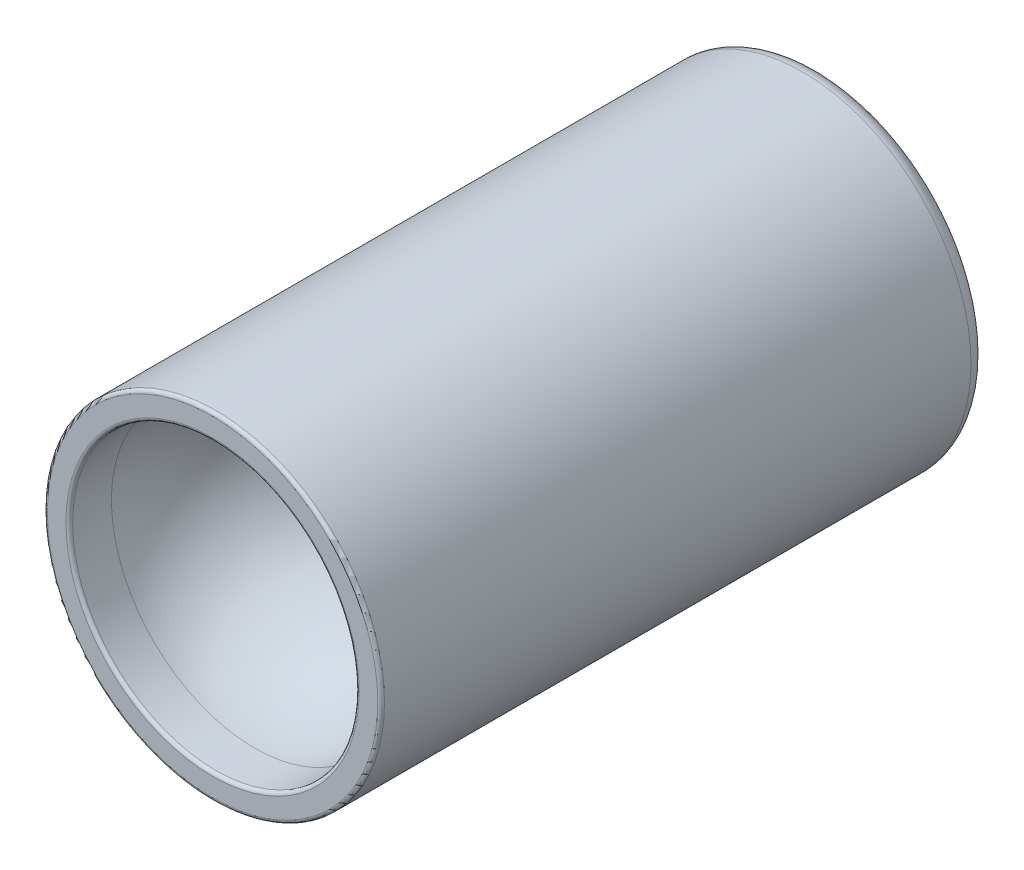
from build123d import *

# Parameters (mm, degrees)
CONG_1_R = 0.2


with BuildPart() as part:
    # Esquisse1 → R_volution1 (revolve)
    with BuildSketch(Plane(origin=(0, 0, 0), x_dir=(0, 0, -1), z_dir=(1, 0, 0)), mode=Mode.PRIVATE) as r_volution1_sk:
        with BuildLine():
            Line((0, 10), (35, 10))
            ThreePointArc((35, 10), (35.707106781, 9.707106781), (36, 9))
            Line((36, 9), (36, 8.5))
            Line((36, 8.5), (27, 8.5))
            ThreePointArc((27, 8.5), (22.75, 7.361215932), (19.638784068, 4.25))
            Line((19.638784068, 4.25), (9.861215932, 4.25))
            ThreePointArc((9.861215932, 4.25), (6.75, 7.361215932), (2.5, 8.5))
            Line((2.5, 8.5), (0, 8.5))
            Line((0, 8.5), (0, 10))
        make_face()
    revolve(r_volution1_sk.sketch.rotate(Axis((0, 0, 0), (0, 0, -1)), 90), axis=Axis((0, 0, 0), (0, 0, -1)))

    # Cong_1
    cong_1_edges = [part.edges().sort_by_distance(p)[0] for p in [
        (-10, 0, 0),
        (-8.5, 0, -36),
        (-4.25, 0, -19.638784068),
        (-4.25, 0, -9.861215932),
        (-8.5, 0, 0),
    ]]
    fillet(cong_1_edges, radius=CONG_1_R)


solid = part.part
